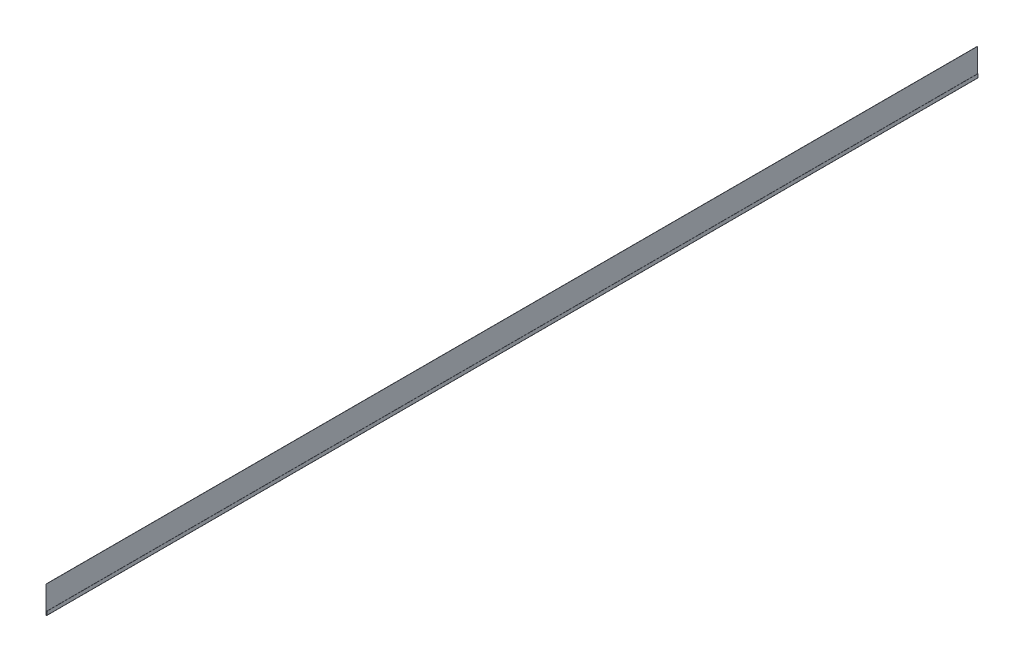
from build123d import *

# Parameters (mm, degrees)
EXTRUDE_THIN1_DEPTH = 3048


with BuildPart() as part:
    # Sketch1 → Extrude-Thin1 (new body)
    with BuildSketch(Plane.XY):
        with BuildLine():
            Line((2.54, 12.7), (2.54, 1.27))
            ThreePointArc((2.54, 1.27), (1.27, 0), (0, 1.27))
            Line((0, 1.27), (0, 88.9))
            Line((0, 88.9), (0.508, 88.9))
            Line((0.508, 88.9), (0.508, 1.27))
            ThreePointArc((0.508, 1.27), (1.27, 0.508), (2.032, 1.27))
            Line((2.032, 1.27), (2.032, 12.7))
            Line((2.032, 12.7), (2.54, 12.7))
        make_face()
    extrude(amount=EXTRUDE_THIN1_DEPTH)


solid = part.part
